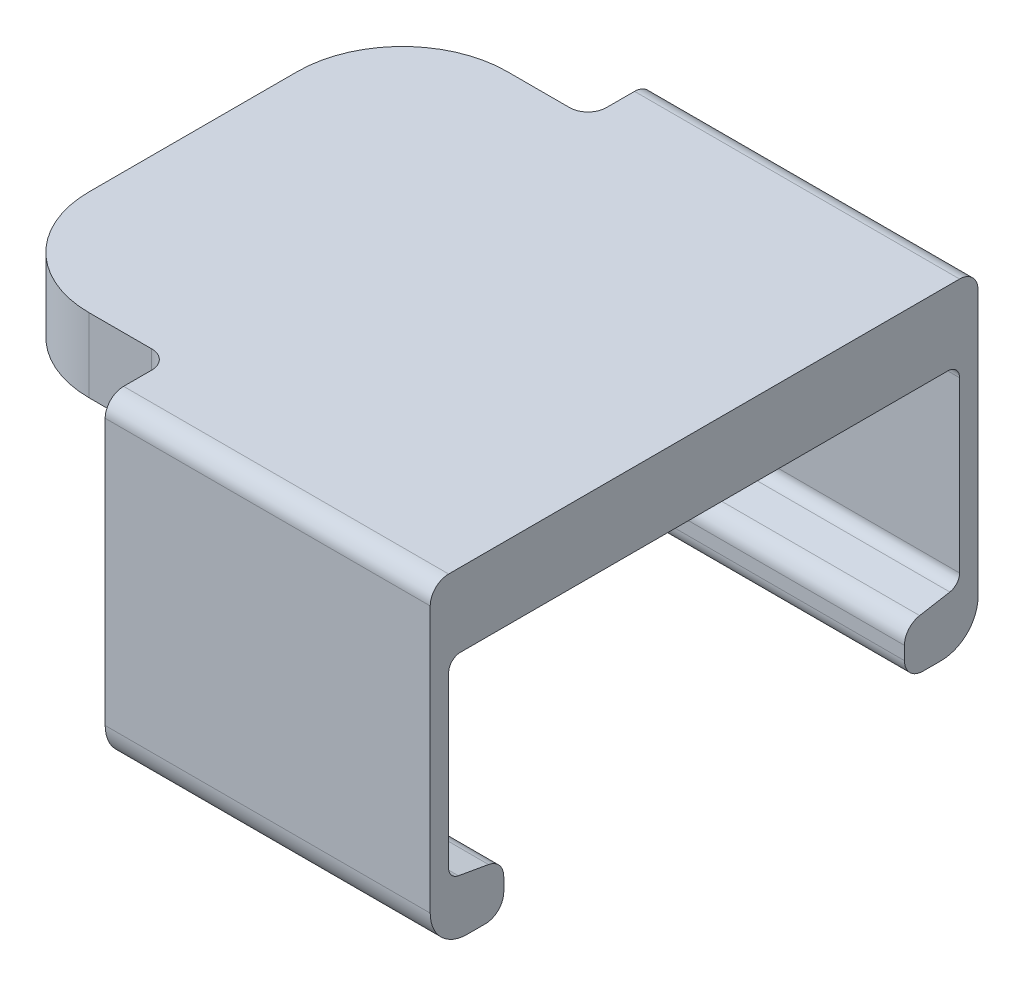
ISO-10303-21;
HEADER;
FILE_DESCRIPTION(('STEP AP214'),'2;1');
FILE_NAME('part.step','',(''),(''),'','','');
FILE_SCHEMA(('AUTOMOTIVE_DESIGN { 1 0 10303 214 1 1 1 1 }'));
ENDSEC;
DATA;
#1=APPLICATION_CONTEXT('core data for automotive mechanical design processes');
#2=APPLICATION_PROTOCOL_DEFINITION('international standard','automotive_design',2000,#1);
#3=PRODUCT_CONTEXT('',#1,'mechanical');
#4=PRODUCT('Part','Part','',(#3));
#5=PRODUCT_RELATED_PRODUCT_CATEGORY('part','',(#4));
#6=PRODUCT_DEFINITION_FORMATION('','',#4);
#7=PRODUCT_DEFINITION_CONTEXT('part definition',#1,'design');
#8=PRODUCT_DEFINITION('design','',#6,#7);
#9=PRODUCT_DEFINITION_SHAPE('','',#8);
#10=(LENGTH_UNIT() NAMED_UNIT(*) SI_UNIT(.MILLI.,.METRE.));
#11=(NAMED_UNIT(*) PLANE_ANGLE_UNIT() SI_UNIT($,.RADIAN.));
#12=(NAMED_UNIT(*) SI_UNIT($,.STERADIAN.) SOLID_ANGLE_UNIT());
#13=UNCERTAINTY_MEASURE_WITH_UNIT(LENGTH_MEASURE(1.E-05),#10,'distance_accuracy_value','');
#14=(GEOMETRIC_REPRESENTATION_CONTEXT(3) GLOBAL_UNCERTAINTY_ASSIGNED_CONTEXT((#13)) GLOBAL_UNIT_ASSIGNED_CONTEXT((#10,
#11,#12)) REPRESENTATION_CONTEXT('',''));
#15=CARTESIAN_POINT('',(0.,0.,0.));
#16=DIRECTION('',(0.,0.,1.));
#17=DIRECTION('',(1.,0.,0.));
#18=AXIS2_PLACEMENT_3D('',#15,#16,#17);
#19=CARTESIAN_POINT('',(-14.,0.,0.));
#20=DIRECTION('',(1.,0.,0.));
#21=DIRECTION('',(0.,0.,-1.));
#22=AXIS2_PLACEMENT_3D('',#19,#20,#21);
#23=PLANE('',#22);
#24=DIRECTION('',(0.,0.,1.));
#25=VECTOR('',#24,1.);
#26=CARTESIAN_POINT('',(-14.,17.358,0.));
#27=LINE('',#26,#25);
#28=CARTESIAN_POINT('',(-14.,17.358,-22.0080000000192));
#29=VERTEX_POINT('',#28);
#30=CARTESIAN_POINT('',(-14.,17.358,-19.5875));
#31=VERTEX_POINT('',#30);
#32=EDGE_CURVE('E300',#29,#31,#27,.T.);
#33=ORIENTED_EDGE('',*,*,#32,.F.);
#34=CARTESIAN_POINT('',(-14.,15.7705,-22.0080000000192));
#35=DIRECTION('',(1.,0.,0.));
#36=DIRECTION('',(0.,0.,-1.));
#37=AXIS2_PLACEMENT_3D('',#34,#35,#36);
#38=CIRCLE('',#37,1.5875);
#39=CARTESIAN_POINT('',(-14.,15.7705,-23.5955000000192));
#40=VERTEX_POINT('',#39);
#41=EDGE_CURVE('E459',#29,#40,#38,.F.);
#42=ORIENTED_EDGE('',*,*,#41,.T.);
#43=DIRECTION('',(0.,1.,0.));
#44=VECTOR('',#43,1.);
#45=CARTESIAN_POINT('',(-14.,17.358,-23.5955000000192));
#46=LINE('',#45,#44);
#47=CARTESIAN_POINT('',(-14.,-7.15034842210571,-23.5955000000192));
#48=VERTEX_POINT('',#47);
#49=EDGE_CURVE('E296',#48,#40,#46,.T.);
#50=ORIENTED_EDGE('',*,*,#49,.F.);
#51=CARTESIAN_POINT('',(-14.,-7.15034842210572,-20.4205000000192));
#52=DIRECTION('',(1.,0.,0.));
#53=DIRECTION('',(0.,0.,-1.));
#54=AXIS2_PLACEMENT_3D('',#51,#52,#53);
#55=CIRCLE('',#54,3.175);
#56=CARTESIAN_POINT('',(-14.,-10.3253484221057,-20.4205000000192));
#57=VERTEX_POINT('',#56);
#58=EDGE_CURVE('E380',#48,#57,#55,.F.);
#59=ORIENTED_EDGE('',*,*,#58,.T.);
#60=DIRECTION('',(0.,0.,-1.));
#61=VECTOR('',#60,1.);
#62=CARTESIAN_POINT('',(-14.,-10.3253484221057,-23.5955000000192));
#63=LINE('',#62,#61);
#64=CARTESIAN_POINT('',(-14.,-10.3253484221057,-18.8455000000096));
#65=VERTEX_POINT('',#64);
#66=EDGE_CURVE('E294',#65,#57,#63,.T.);
#67=ORIENTED_EDGE('',*,*,#66,.F.);
#68=CARTESIAN_POINT('',(-14.,-8.73784842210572,-18.8455000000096));
#69=DIRECTION('',(1.,0.,0.));
#70=DIRECTION('',(0.,0.,-1.));
#71=AXIS2_PLACEMENT_3D('',#68,#69,#70);
#72=CIRCLE('',#71,1.5875);
#73=CARTESIAN_POINT('',(-14.,-8.73784842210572,-17.2580000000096));
#74=VERTEX_POINT('',#73);
#75=EDGE_CURVE('E455',#65,#74,#72,.F.);
#76=ORIENTED_EDGE('',*,*,#75,.T.);
#77=DIRECTION('',(0.,-1.,0.));
#78=VECTOR('',#77,1.);
#79=CARTESIAN_POINT('',(-14.,-6.26381577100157,-17.2580000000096));
#80=LINE('',#79,#78);
#81=CARTESIAN_POINT('',(-14.,-7.5958864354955,-17.2580000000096));
#82=VERTEX_POINT('',#81);
#83=EDGE_CURVE('E291',#82,#74,#80,.T.);
#84=ORIENTED_EDGE('',*,*,#83,.F.);
#85=CARTESIAN_POINT('',(-14.,-7.5958864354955,-18.8455000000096));
#86=DIRECTION('',(1.,0.,0.));
#87=DIRECTION('',(0.,0.,-1.));
#88=AXIS2_PLACEMENT_3D('',#85,#86,#87);
#89=CIRCLE('',#88,1.5875);
#90=CARTESIAN_POINT('',(-14.,-6.03250412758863,-18.5698335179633));
#91=VERTEX_POINT('',#90);
#92=EDGE_CURVE('E453',#82,#91,#89,.F.);
#93=ORIENTED_EDGE('',*,*,#92,.T.);
#94=DIRECTION('',(0.,-0.173648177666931,0.984807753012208));
#95=VECTOR('',#94,1.);
#96=CARTESIAN_POINT('',(-14.,-6.26381577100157,-17.2580000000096));
#97=LINE('',#96,#95);
#98=CARTESIAN_POINT('',(-14.,-5.57430206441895,-21.1684265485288));
#99=VERTEX_POINT('',#98);
#100=EDGE_CURVE('E288',#99,#91,#97,.T.);
#101=ORIENTED_EDGE('',*,*,#100,.F.);
#102=CARTESIAN_POINT('',(-14.,-4.57373738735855,-20.9920000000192));
#103=DIRECTION('',(1.,0.,0.));
#104=DIRECTION('',(0.,0.,-1.));
#105=AXIS2_PLACEMENT_3D('',#102,#103,#104);
#106=CIRCLE('',#105,1.016);
#107=CARTESIAN_POINT('',(-14.,-4.57373738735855,-22.0080000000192));
#108=VERTEX_POINT('',#107);
#109=EDGE_CURVE('E412',#99,#108,#106,.T.);
#110=ORIENTED_EDGE('',*,*,#109,.T.);
#111=DIRECTION('',(0.,-1.,0.));
#112=VECTOR('',#111,1.);
#113=CARTESIAN_POINT('',(-14.,-5.42626261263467,-22.0080000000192));
#114=LINE('',#113,#112);
#115=CARTESIAN_POINT('',(-14.,9.992,-22.0080000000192));
#116=VERTEX_POINT('',#115);
#117=EDGE_CURVE('E319',#116,#108,#114,.T.);
#118=ORIENTED_EDGE('',*,*,#117,.F.);
#119=CARTESIAN_POINT('',(-14.,9.992,-20.9920000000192));
#120=DIRECTION('',(1.,0.,0.));
#121=DIRECTION('',(0.,0.,-1.));
#122=AXIS2_PLACEMENT_3D('',#119,#120,#121);
#123=CIRCLE('',#122,1.016);
#124=CARTESIAN_POINT('',(-14.,11.008,-20.9920000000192));
#125=VERTEX_POINT('',#124);
#126=EDGE_CURVE('E420',#116,#125,#123,.T.);
#127=ORIENTED_EDGE('',*,*,#126,.T.);
#128=DIRECTION('',(0.,0.,-1.));
#129=VECTOR('',#128,1.);
#130=CARTESIAN_POINT('',(-14.,11.008,0.));
#131=LINE('',#130,#129);
#132=CARTESIAN_POINT('',(-14.,11.008,-19.5875));
#133=VERTEX_POINT('',#132);
#134=EDGE_CURVE('E316',#133,#125,#131,.T.);
#135=ORIENTED_EDGE('',*,*,#134,.F.);
#136=DIRECTION('',(0.,-1.,0.));
#137=VECTOR('',#136,1.);
#138=CARTESIAN_POINT('',(-14.,17.358,-19.5875));
#139=LINE('',#138,#137);
#140=EDGE_CURVE('E457',#133,#31,#139,.F.);
#141=ORIENTED_EDGE('',*,*,#140,.T.);
#142=EDGE_LOOP('',(#33,#42,#50,#59,#67,#76,#84,#93,#101,#110,#118,#127,#135,#141));
#143=FACE_BOUND('',#142,.T.);
#144=ADVANCED_FACE('F35',(#143),#23,.F.);
#145=DIRECTION('',(0.,-1.,0.));
#146=VECTOR('',#145,1.);
#147=CARTESIAN_POINT('',(-14.,17.358,23.5955000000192));
#148=LINE('',#147,#146);
#149=CARTESIAN_POINT('',(-14.,15.7705,23.5955000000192));
#150=VERTEX_POINT('',#149);
#151=CARTESIAN_POINT('',(-14.,-7.15034842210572,23.5955000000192));
#152=VERTEX_POINT('',#151);
#153=EDGE_CURVE('E303',#150,#152,#148,.T.);
#154=ORIENTED_EDGE('',*,*,#153,.F.);
#155=CARTESIAN_POINT('',(-14.,15.7705,22.0080000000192));
#156=DIRECTION('',(1.,0.,0.));
#157=DIRECTION('',(0.,0.,-1.));
#158=AXIS2_PLACEMENT_3D('',#155,#156,#157);
#159=CIRCLE('',#158,1.5875);
#160=CARTESIAN_POINT('',(-14.,17.358,22.0080000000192));
#161=VERTEX_POINT('',#160);
#162=EDGE_CURVE('E434',#150,#161,#159,.F.);
#163=ORIENTED_EDGE('',*,*,#162,.T.);
#164=CARTESIAN_POINT('',(-14.,17.358,19.5875));
#165=VERTEX_POINT('',#164);
#166=EDGE_CURVE('E299',#165,#161,#27,.T.);
#167=ORIENTED_EDGE('',*,*,#166,.F.);
#168=DIRECTION('',(0.,1.,0.));
#169=VECTOR('',#168,1.);
#170=CARTESIAN_POINT('',(-14.,11.008,19.5875));
#171=LINE('',#170,#169);
#172=CARTESIAN_POINT('',(-14.,11.008,19.5875));
#173=VERTEX_POINT('',#172);
#174=EDGE_CURVE('E432',#165,#173,#171,.F.);
#175=ORIENTED_EDGE('',*,*,#174,.T.);
#176=CARTESIAN_POINT('',(-14.,11.008,20.9920000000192));
#177=VERTEX_POINT('',#176);
#178=EDGE_CURVE('E317',#177,#173,#131,.T.);
#179=ORIENTED_EDGE('',*,*,#178,.F.);
#180=CARTESIAN_POINT('',(-14.,9.992,20.9920000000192));
#181=DIRECTION('',(1.,0.,0.));
#182=DIRECTION('',(0.,0.,-1.));
#183=AXIS2_PLACEMENT_3D('',#180,#181,#182);
#184=CIRCLE('',#183,1.016);
#185=CARTESIAN_POINT('',(-14.,9.992,22.0080000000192));
#186=VERTEX_POINT('',#185);
#187=EDGE_CURVE('E416',#177,#186,#184,.T.);
#188=ORIENTED_EDGE('',*,*,#187,.T.);
#189=DIRECTION('',(0.,1.,0.));
#190=VECTOR('',#189,1.);
#191=CARTESIAN_POINT('',(-14.,-5.42626261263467,22.0080000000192));
#192=LINE('',#191,#190);
#193=CARTESIAN_POINT('',(-14.,-4.57373738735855,22.0080000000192));
#194=VERTEX_POINT('',#193);
#195=EDGE_CURVE('E313',#194,#186,#192,.T.);
#196=ORIENTED_EDGE('',*,*,#195,.F.);
#197=CARTESIAN_POINT('',(-14.,-4.57373738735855,20.9920000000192));
#198=DIRECTION('',(1.,0.,0.));
#199=DIRECTION('',(0.,0.,-1.));
#200=AXIS2_PLACEMENT_3D('',#197,#198,#199);
#201=CIRCLE('',#200,1.016);
#202=CARTESIAN_POINT('',(-14.,-5.57430206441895,21.1684265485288));
#203=VERTEX_POINT('',#202);
#204=EDGE_CURVE('E407',#194,#203,#201,.T.);
#205=ORIENTED_EDGE('',*,*,#204,.T.);
#206=DIRECTION('',(0.,0.173648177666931,0.984807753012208));
#207=VECTOR('',#206,1.);
#208=CARTESIAN_POINT('',(-14.,-6.26381577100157,17.2580000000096));
#209=LINE('',#208,#207);
#210=CARTESIAN_POINT('',(-14.,-6.03250412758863,18.5698335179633));
#211=VERTEX_POINT('',#210);
#212=EDGE_CURVE('E311',#211,#203,#209,.T.);
#213=ORIENTED_EDGE('',*,*,#212,.F.);
#214=CARTESIAN_POINT('',(-14.,-7.5958864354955,18.8455000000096));
#215=DIRECTION('',(1.,0.,0.));
#216=DIRECTION('',(0.,0.,-1.));
#217=AXIS2_PLACEMENT_3D('',#214,#215,#216);
#218=CIRCLE('',#217,1.5875);
#219=CARTESIAN_POINT('',(-14.,-7.5958864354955,17.2580000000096));
#220=VERTEX_POINT('',#219);
#221=EDGE_CURVE('E428',#211,#220,#218,.F.);
#222=ORIENTED_EDGE('',*,*,#221,.T.);
#223=DIRECTION('',(0.,1.,0.));
#224=VECTOR('',#223,1.);
#225=CARTESIAN_POINT('',(-14.,-6.26381577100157,17.2580000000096));
#226=LINE('',#225,#224);
#227=CARTESIAN_POINT('',(-14.,-8.73784842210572,17.2580000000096));
#228=VERTEX_POINT('',#227);
#229=EDGE_CURVE('E308',#228,#220,#226,.T.);
#230=ORIENTED_EDGE('',*,*,#229,.F.);
#231=CARTESIAN_POINT('',(-14.,-8.73784842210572,18.8455000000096));
#232=DIRECTION('',(1.,0.,0.));
#233=DIRECTION('',(0.,0.,-1.));
#234=AXIS2_PLACEMENT_3D('',#231,#232,#233);
#235=CIRCLE('',#234,1.5875);
#236=CARTESIAN_POINT('',(-14.,-10.3253484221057,18.8455000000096));
#237=VERTEX_POINT('',#236);
#238=EDGE_CURVE('E430',#228,#237,#235,.F.);
#239=ORIENTED_EDGE('',*,*,#238,.T.);
#240=DIRECTION('',(0.,0.,-1.));
#241=VECTOR('',#240,1.);
#242=CARTESIAN_POINT('',(-14.,-10.3253484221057,23.5955000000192));
#243=LINE('',#242,#241);
#244=CARTESIAN_POINT('',(-14.,-10.3253484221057,20.4205000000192));
#245=VERTEX_POINT('',#244);
#246=EDGE_CURVE('E305',#245,#237,#243,.T.);
#247=ORIENTED_EDGE('',*,*,#246,.F.);
#248=CARTESIAN_POINT('',(-14.,-7.15034842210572,20.4205000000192));
#249=DIRECTION('',(1.,0.,0.));
#250=DIRECTION('',(0.,0.,-1.));
#251=AXIS2_PLACEMENT_3D('',#248,#249,#250);
#252=CIRCLE('',#251,3.175);
#253=EDGE_CURVE('E367',#245,#152,#252,.F.);
#254=ORIENTED_EDGE('',*,*,#253,.T.);
#255=EDGE_LOOP('',(#154,#163,#167,#175,#179,#188,#196,#205,#213,#222,#230,#239,#247,#254));
#256=FACE_BOUND('',#255,.T.);
#257=ADVANCED_FACE('F518',(#256),#23,.F.);
#258=CARTESIAN_POINT('',(14.,-6.26381577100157,-17.2580000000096));
#259=DIRECTION('',(0.,-0.984807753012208,-0.173648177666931));
#260=DIRECTION('',(0.,0.173648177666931,-0.984807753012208));
#261=AXIS2_PLACEMENT_3D('',#258,#259,#260);
#262=PLANE('',#261);
#263=ORIENTED_EDGE('',*,*,#100,.T.);
#264=DIRECTION('',(-1.,0.,0.));
#265=VECTOR('',#264,1.);
#266=CARTESIAN_POINT('',(14.,-6.03250412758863,-18.5698335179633));
#267=LINE('',#266,#265);
#268=CARTESIAN_POINT('',(14.,-6.03250412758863,-18.5698335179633));
#269=VERTEX_POINT('',#268);
#270=EDGE_CURVE('E486',#91,#269,#267,.F.);
#271=ORIENTED_EDGE('',*,*,#270,.T.);
#272=DIRECTION('',(0.,-0.173648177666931,0.984807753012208));
#273=VECTOR('',#272,1.);
#274=CARTESIAN_POINT('',(14.,-6.26381577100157,-17.2580000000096));
#275=LINE('',#274,#273);
#276=CARTESIAN_POINT('',(14.,-5.57430206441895,-21.1684265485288));
#277=VERTEX_POINT('',#276);
#278=EDGE_CURVE('E322',#277,#269,#275,.T.);
#279=ORIENTED_EDGE('',*,*,#278,.F.);
#280=DIRECTION('',(-1.,0.,0.));
#281=VECTOR('',#280,1.);
#282=CARTESIAN_POINT('',(-14.,-5.57430206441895,-21.1684265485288));
#283=LINE('',#282,#281);
#284=EDGE_CURVE('E394',#277,#99,#283,.T.);
#285=ORIENTED_EDGE('',*,*,#284,.T.);
#286=EDGE_LOOP('',(#263,#271,#279,#285));
#287=FACE_BOUND('',#286,.T.);
#288=ADVANCED_FACE('F522',(#287),#262,.F.);
#289=CARTESIAN_POINT('',(14.,-6.26381577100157,-17.2580000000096));
#290=DIRECTION('',(0.,0.,-1.));
#291=DIRECTION('',(-1.,0.,0.));
#292=AXIS2_PLACEMENT_3D('',#289,#290,#291);
#293=PLANE('',#292);
#294=ORIENTED_EDGE('',*,*,#83,.T.);
#295=DIRECTION('',(-1.,0.,0.));
#296=VECTOR('',#295,1.);
#297=CARTESIAN_POINT('',(14.,-8.73784842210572,-17.2580000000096));
#298=LINE('',#297,#296);
#299=CARTESIAN_POINT('',(14.,-8.73784842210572,-17.2580000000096));
#300=VERTEX_POINT('',#299);
#301=EDGE_CURVE('E474',#74,#300,#298,.F.);
#302=ORIENTED_EDGE('',*,*,#301,.T.);
#303=DIRECTION('',(0.,-1.,0.));
#304=VECTOR('',#303,1.);
#305=CARTESIAN_POINT('',(14.,-6.26381577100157,-17.2580000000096));
#306=LINE('',#305,#304);
#307=CARTESIAN_POINT('',(14.,-7.5958864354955,-17.2580000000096));
#308=VERTEX_POINT('',#307);
#309=EDGE_CURVE('E325',#308,#300,#306,.T.);
#310=ORIENTED_EDGE('',*,*,#309,.F.);
#311=DIRECTION('',(-1.,0.,0.));
#312=VECTOR('',#311,1.);
#313=CARTESIAN_POINT('',(14.,-7.5958864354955,-17.2580000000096));
#314=LINE('',#313,#312);
#315=EDGE_CURVE('E471',#308,#82,#314,.T.);
#316=ORIENTED_EDGE('',*,*,#315,.T.);
#317=EDGE_LOOP('',(#294,#302,#310,#316));
#318=FACE_BOUND('',#317,.T.);
#319=ADVANCED_FACE('F560',(#318),#293,.F.);
#320=CARTESIAN_POINT('',(14.,-10.3253484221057,-23.5955000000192));
#321=DIRECTION('',(0.,1.,0.));
#322=DIRECTION('',(0.,0.,1.));
#323=AXIS2_PLACEMENT_3D('',#320,#321,#322);
#324=PLANE('',#323);
#325=DIRECTION('',(0.,0.,-1.));
#326=VECTOR('',#325,1.);
#327=CARTESIAN_POINT('',(14.,-10.3253484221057,-23.5955000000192));
#328=LINE('',#327,#326);
#329=CARTESIAN_POINT('',(14.,-10.3253484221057,-18.8455000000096));
#330=VERTEX_POINT('',#329);
#331=CARTESIAN_POINT('',(14.,-10.3253484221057,-20.4205000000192));
#332=VERTEX_POINT('',#331);
#333=EDGE_CURVE('E328',#330,#332,#328,.T.);
#334=ORIENTED_EDGE('',*,*,#333,.F.);
#335=DIRECTION('',(-1.,0.,0.));
#336=VECTOR('',#335,1.);
#337=CARTESIAN_POINT('',(14.,-10.3253484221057,-18.8455000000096));
#338=LINE('',#337,#336);
#339=EDGE_CURVE('E468',#330,#65,#338,.T.);
#340=ORIENTED_EDGE('',*,*,#339,.T.);
#341=ORIENTED_EDGE('',*,*,#66,.T.);
#342=DIRECTION('',(-1.,0.,0.));
#343=VECTOR('',#342,1.);
#344=CARTESIAN_POINT('',(14.,-10.3253484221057,-20.4205000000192));
#345=LINE('',#344,#343);
#346=EDGE_CURVE('E383',#57,#332,#345,.F.);
#347=ORIENTED_EDGE('',*,*,#346,.T.);
#348=EDGE_LOOP('',(#334,#340,#341,#347));
#349=FACE_BOUND('',#348,.T.);
#350=ADVANCED_FACE('F556',(#349),#324,.F.);
#351=CARTESIAN_POINT('',(14.,17.358,-23.5955000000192));
#352=DIRECTION('',(0.,0.,1.));
#353=DIRECTION('',(0.,-1.,0.));
#354=AXIS2_PLACEMENT_3D('',#351,#352,#353);
#355=PLANE('',#354);
#356=ORIENTED_EDGE('',*,*,#49,.T.);
#357=DIRECTION('',(-1.,0.,0.));
#358=VECTOR('',#357,1.);
#359=CARTESIAN_POINT('',(14.,15.7705,-23.5955000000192));
#360=LINE('',#359,#358);
#361=CARTESIAN_POINT('',(14.,15.7705,-23.5955000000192));
#362=VERTEX_POINT('',#361);
#363=EDGE_CURVE('E461',#40,#362,#360,.F.);
#364=ORIENTED_EDGE('',*,*,#363,.T.);
#365=DIRECTION('',(0.,1.,0.));
#366=VECTOR('',#365,1.);
#367=CARTESIAN_POINT('',(14.,17.358,-23.5955000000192));
#368=LINE('',#367,#366);
#369=CARTESIAN_POINT('',(14.,-7.15034842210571,-23.5955000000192));
#370=VERTEX_POINT('',#369);
#371=EDGE_CURVE('E330',#370,#362,#368,.T.);
#372=ORIENTED_EDGE('',*,*,#371,.F.);
#373=DIRECTION('',(-1.,0.,0.));
#374=VECTOR('',#373,1.);
#375=CARTESIAN_POINT('',(14.,-7.15034842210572,-23.5955000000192));
#376=LINE('',#375,#374);
#377=EDGE_CURVE('E377',#370,#48,#376,.T.);
#378=ORIENTED_EDGE('',*,*,#377,.T.);
#379=EDGE_LOOP('',(#356,#364,#372,#378));
#380=FACE_BOUND('',#379,.T.);
#381=ADVANCED_FACE('F553',(#380),#355,.F.);
#382=CARTESIAN_POINT('',(14.,17.358,0.));
#383=DIRECTION('',(0.,-1.,0.));
#384=DIRECTION('',(0.,0.,-1.));
#385=AXIS2_PLACEMENT_3D('',#382,#383,#384);
#386=PLANE('',#385);
#387=ORIENTED_EDGE('',*,*,#166,.T.);
#388=DIRECTION('',(-1.,0.,0.));
#389=VECTOR('',#388,1.);
#390=CARTESIAN_POINT('',(14.,17.358,22.0080000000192));
#391=LINE('',#390,#389);
#392=CARTESIAN_POINT('',(14.,17.358,22.0080000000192));
#393=VERTEX_POINT('',#392);
#394=EDGE_CURVE('E439',#161,#393,#391,.F.);
#395=ORIENTED_EDGE('',*,*,#394,.T.);
#396=DIRECTION('',(0.,0.,1.));
#397=VECTOR('',#396,1.);
#398=CARTESIAN_POINT('',(14.,17.358,0.));
#399=LINE('',#398,#397);
#400=CARTESIAN_POINT('',(14.,17.358,-22.0080000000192));
#401=VERTEX_POINT('',#400);
#402=EDGE_CURVE('E333',#401,#393,#399,.T.);
#403=ORIENTED_EDGE('',*,*,#402,.F.);
#404=DIRECTION('',(-1.,0.,0.));
#405=VECTOR('',#404,1.);
#406=CARTESIAN_POINT('',(14.,17.358,-22.0080000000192));
#407=LINE('',#406,#405);
#408=EDGE_CURVE('E436',#401,#29,#407,.T.);
#409=ORIENTED_EDGE('',*,*,#408,.T.);
#410=ORIENTED_EDGE('',*,*,#32,.T.);
#411=CARTESIAN_POINT('',(-15.5875,17.358,-19.5875));
#412=DIRECTION('',(0.,-1.,0.));
#413=DIRECTION('',(0.,0.,-1.));
#414=AXIS2_PLACEMENT_3D('',#411,#412,#413);
#415=CIRCLE('',#414,1.5875);
#416=CARTESIAN_POINT('',(-15.5875,17.358,-18.));
#417=VERTEX_POINT('',#416);
#418=EDGE_CURVE('E11',#31,#417,#415,.T.);
#419=ORIENTED_EDGE('',*,*,#418,.T.);
#420=DIRECTION('',(1.,0.,0.));
#421=VECTOR('',#420,1.);
#422=CARTESIAN_POINT('',(-30.,17.358,-18.));
#423=LINE('',#422,#421);
#424=CARTESIAN_POINT('',(-20.9703,17.358,-18.));
#425=VERTEX_POINT('',#424);
#426=EDGE_CURVE('E272',#425,#417,#423,.T.);
#427=ORIENTED_EDGE('',*,*,#426,.F.);
#428=CARTESIAN_POINT('',(-20.9703,17.358,-8.9703));
#429=DIRECTION('',(0.,-1.,0.));
#430=DIRECTION('',(0.,0.,-1.));
#431=AXIS2_PLACEMENT_3D('',#428,#429,#430);
#432=CIRCLE('',#431,9.0297);
#433=CARTESIAN_POINT('',(-30.,17.358,-8.9703));
#434=VERTEX_POINT('',#433);
#435=EDGE_CURVE('E360',#425,#434,#432,.F.);
#436=ORIENTED_EDGE('',*,*,#435,.T.);
#437=DIRECTION('',(0.,0.,-1.));
#438=VECTOR('',#437,1.);
#439=CARTESIAN_POINT('',(-30.,17.358,-18.));
#440=LINE('',#439,#438);
#441=CARTESIAN_POINT('',(-30.,17.358,8.9703));
#442=VERTEX_POINT('',#441);
#443=EDGE_CURVE('E264',#442,#434,#440,.T.);
#444=ORIENTED_EDGE('',*,*,#443,.F.);
#445=CARTESIAN_POINT('',(-20.9703,17.358,8.97029999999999));
#446=DIRECTION('',(0.,-1.,0.));
#447=DIRECTION('',(0.,0.,-1.));
#448=AXIS2_PLACEMENT_3D('',#445,#446,#447);
#449=CIRCLE('',#448,9.0297);
#450=CARTESIAN_POINT('',(-20.9703,17.358,18.));
#451=VERTEX_POINT('',#450);
#452=EDGE_CURVE('E358',#442,#451,#449,.F.);
#453=ORIENTED_EDGE('',*,*,#452,.T.);
#454=DIRECTION('',(1.,0.,0.));
#455=VECTOR('',#454,1.);
#456=CARTESIAN_POINT('',(-30.,17.358,18.));
#457=LINE('',#456,#455);
#458=CARTESIAN_POINT('',(-15.5875,17.358,18.));
#459=VERTEX_POINT('',#458);
#460=EDGE_CURVE('E281',#451,#459,#457,.T.);
#461=ORIENTED_EDGE('',*,*,#460,.T.);
#462=CARTESIAN_POINT('',(-15.5875,17.358,19.5875));
#463=DIRECTION('',(0.,-1.,0.));
#464=DIRECTION('',(0.,0.,-1.));
#465=AXIS2_PLACEMENT_3D('',#462,#463,#464);
#466=CIRCLE('',#465,1.5875);
#467=EDGE_CURVE('E488',#459,#165,#466,.T.);
#468=ORIENTED_EDGE('',*,*,#467,.T.);
#469=EDGE_LOOP('',(#387,#395,#403,#409,#410,#419,#427,#436,#444,#453,#461,#468));
#470=FACE_BOUND('',#469,.T.);
#471=ADVANCED_FACE('F500',(#470),#386,.F.);
#472=CARTESIAN_POINT('',(14.,17.358,23.5955000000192));
#473=DIRECTION('',(0.,0.,-1.));
#474=DIRECTION('',(0.,1.,0.));
#475=AXIS2_PLACEMENT_3D('',#472,#473,#474);
#476=PLANE('',#475);
#477=DIRECTION('',(0.,-1.,0.));
#478=VECTOR('',#477,1.);
#479=CARTESIAN_POINT('',(14.,17.358,23.5955000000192));
#480=LINE('',#479,#478);
#481=CARTESIAN_POINT('',(14.,15.7705,23.5955000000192));
#482=VERTEX_POINT('',#481);
#483=CARTESIAN_POINT('',(14.,-7.15034842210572,23.5955000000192));
#484=VERTEX_POINT('',#483);
#485=EDGE_CURVE('E336',#482,#484,#480,.T.);
#486=ORIENTED_EDGE('',*,*,#485,.F.);
#487=DIRECTION('',(-1.,0.,0.));
#488=VECTOR('',#487,1.);
#489=CARTESIAN_POINT('',(14.,15.7705,23.5955000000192));
#490=LINE('',#489,#488);
#491=EDGE_CURVE('E425',#482,#150,#490,.T.);
#492=ORIENTED_EDGE('',*,*,#491,.T.);
#493=ORIENTED_EDGE('',*,*,#153,.T.);
#494=DIRECTION('',(-1.,0.,0.));
#495=VECTOR('',#494,1.);
#496=CARTESIAN_POINT('',(14.,-7.15034842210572,23.5955000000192));
#497=LINE('',#496,#495);
#498=EDGE_CURVE('E370',#152,#484,#497,.F.);
#499=ORIENTED_EDGE('',*,*,#498,.T.);
#500=EDGE_LOOP('',(#486,#492,#493,#499));
#501=FACE_BOUND('',#500,.T.);
#502=ADVANCED_FACE('F546',(#501),#476,.F.);
#503=CARTESIAN_POINT('',(14.,-10.3253484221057,23.5955000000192));
#504=DIRECTION('',(0.,1.,0.));
#505=DIRECTION('',(0.,0.,1.));
#506=AXIS2_PLACEMENT_3D('',#503,#504,#505);
#507=PLANE('',#506);
#508=ORIENTED_EDGE('',*,*,#246,.T.);
#509=DIRECTION('',(-1.,0.,0.));
#510=VECTOR('',#509,1.);
#511=CARTESIAN_POINT('',(14.,-10.3253484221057,18.8455000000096));
#512=LINE('',#511,#510);
#513=CARTESIAN_POINT('',(14.,-10.3253484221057,18.8455000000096));
#514=VERTEX_POINT('',#513);
#515=EDGE_CURVE('E481',#237,#514,#512,.F.);
#516=ORIENTED_EDGE('',*,*,#515,.T.);
#517=DIRECTION('',(0.,0.,-1.));
#518=VECTOR('',#517,1.);
#519=CARTESIAN_POINT('',(14.,-10.3253484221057,23.5955000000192));
#520=LINE('',#519,#518);
#521=CARTESIAN_POINT('',(14.,-10.3253484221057,20.4205000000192));
#522=VERTEX_POINT('',#521);
#523=EDGE_CURVE('E338',#522,#514,#520,.T.);
#524=ORIENTED_EDGE('',*,*,#523,.F.);
#525=DIRECTION('',(-1.,0.,0.));
#526=VECTOR('',#525,1.);
#527=CARTESIAN_POINT('',(14.,-10.3253484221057,20.4205000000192));
#528=LINE('',#527,#526);
#529=EDGE_CURVE('E364',#522,#245,#528,.T.);
#530=ORIENTED_EDGE('',*,*,#529,.T.);
#531=EDGE_LOOP('',(#508,#516,#524,#530));
#532=FACE_BOUND('',#531,.T.);
#533=ADVANCED_FACE('F542',(#532),#507,.F.);
#534=CARTESIAN_POINT('',(14.,-6.26381577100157,17.2580000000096));
#535=DIRECTION('',(0.,0.,1.));
#536=DIRECTION('',(1.,0.,0.));
#537=AXIS2_PLACEMENT_3D('',#534,#535,#536);
#538=PLANE('',#537);
#539=DIRECTION('',(0.,1.,0.));
#540=VECTOR('',#539,1.);
#541=CARTESIAN_POINT('',(14.,-6.26381577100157,17.2580000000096));
#542=LINE('',#541,#540);
#543=CARTESIAN_POINT('',(14.,-8.73784842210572,17.2580000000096));
#544=VERTEX_POINT('',#543);
#545=CARTESIAN_POINT('',(14.,-7.5958864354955,17.2580000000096));
#546=VERTEX_POINT('',#545);
#547=EDGE_CURVE('E341',#544,#546,#542,.T.);
#548=ORIENTED_EDGE('',*,*,#547,.F.);
#549=DIRECTION('',(-1.,0.,0.));
#550=VECTOR('',#549,1.);
#551=CARTESIAN_POINT('',(14.,-8.73784842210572,17.2580000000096));
#552=LINE('',#551,#550);
#553=EDGE_CURVE('E478',#544,#228,#552,.T.);
#554=ORIENTED_EDGE('',*,*,#553,.T.);
#555=ORIENTED_EDGE('',*,*,#229,.T.);
#556=DIRECTION('',(-1.,0.,0.));
#557=VECTOR('',#556,1.);
#558=CARTESIAN_POINT('',(14.,-7.5958864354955,17.2580000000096));
#559=LINE('',#558,#557);
#560=EDGE_CURVE('E476',#220,#546,#559,.F.);
#561=ORIENTED_EDGE('',*,*,#560,.T.);
#562=EDGE_LOOP('',(#548,#554,#555,#561));
#563=FACE_BOUND('',#562,.T.);
#564=ADVANCED_FACE('F538',(#563),#538,.F.);
#565=CARTESIAN_POINT('',(14.,-6.26381577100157,17.2580000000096));
#566=DIRECTION('',(0.,-0.984807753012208,0.173648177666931));
#567=DIRECTION('',(0.,-0.173648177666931,-0.984807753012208));
#568=AXIS2_PLACEMENT_3D('',#565,#566,#567);
#569=PLANE('',#568);
#570=DIRECTION('',(0.,0.173648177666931,0.984807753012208));
#571=VECTOR('',#570,1.);
#572=CARTESIAN_POINT('',(14.,-6.26381577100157,17.2580000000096));
#573=LINE('',#572,#571);
#574=CARTESIAN_POINT('',(14.,-6.03250412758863,18.5698335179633));
#575=VERTEX_POINT('',#574);
#576=CARTESIAN_POINT('',(14.,-5.57430206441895,21.1684265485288));
#577=VERTEX_POINT('',#576);
#578=EDGE_CURVE('E344',#575,#577,#573,.T.);
#579=ORIENTED_EDGE('',*,*,#578,.F.);
#580=DIRECTION('',(-1.,0.,0.));
#581=VECTOR('',#580,1.);
#582=CARTESIAN_POINT('',(14.,-6.03250412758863,18.5698335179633));
#583=LINE('',#582,#581);
#584=EDGE_CURVE('E483',#575,#211,#583,.T.);
#585=ORIENTED_EDGE('',*,*,#584,.T.);
#586=ORIENTED_EDGE('',*,*,#212,.T.);
#587=DIRECTION('',(-1.,0.,0.));
#588=VECTOR('',#587,1.);
#589=CARTESIAN_POINT('',(14.,-5.57430206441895,21.1684265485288));
#590=LINE('',#589,#588);
#591=EDGE_CURVE('E391',#203,#577,#590,.F.);
#592=ORIENTED_EDGE('',*,*,#591,.T.);
#593=EDGE_LOOP('',(#579,#585,#586,#592));
#594=FACE_BOUND('',#593,.T.);
#595=ADVANCED_FACE('F534',(#594),#569,.F.);
#596=CARTESIAN_POINT('',(14.,-5.42626261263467,22.0080000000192));
#597=DIRECTION('',(0.,0.,1.));
#598=DIRECTION('',(1.,0.,0.));
#599=AXIS2_PLACEMENT_3D('',#596,#597,#598);
#600=PLANE('',#599);
#601=DIRECTION('',(0.,1.,0.));
#602=VECTOR('',#601,1.);
#603=CARTESIAN_POINT('',(14.,-5.42626261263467,22.0080000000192));
#604=LINE('',#603,#602);
#605=CARTESIAN_POINT('',(14.,-4.57373738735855,22.0080000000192));
#606=VERTEX_POINT('',#605);
#607=CARTESIAN_POINT('',(14.,9.992,22.0080000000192));
#608=VERTEX_POINT('',#607);
#609=EDGE_CURVE('E346',#606,#608,#604,.T.);
#610=ORIENTED_EDGE('',*,*,#609,.F.);
#611=DIRECTION('',(-1.,0.,0.));
#612=VECTOR('',#611,1.);
#613=CARTESIAN_POINT('',(-14.,-4.57373738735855,22.0080000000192));
#614=LINE('',#613,#612);
#615=EDGE_CURVE('E388',#606,#194,#614,.T.);
#616=ORIENTED_EDGE('',*,*,#615,.T.);
#617=ORIENTED_EDGE('',*,*,#195,.T.);
#618=DIRECTION('',(-1.,0.,0.));
#619=VECTOR('',#618,1.);
#620=CARTESIAN_POINT('',(14.,9.992,22.0080000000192));
#621=LINE('',#620,#619);
#622=EDGE_CURVE('E386',#186,#608,#621,.F.);
#623=ORIENTED_EDGE('',*,*,#622,.T.);
#624=EDGE_LOOP('',(#610,#616,#617,#623));
#625=FACE_BOUND('',#624,.T.);
#626=ADVANCED_FACE('F530',(#625),#600,.F.);
#627=CARTESIAN_POINT('',(14.,11.008,0.));
#628=DIRECTION('',(0.,1.,0.));
#629=DIRECTION('',(0.,0.,1.));
#630=AXIS2_PLACEMENT_3D('',#627,#628,#629);
#631=PLANE('',#630);
#632=CARTESIAN_POINT('',(-20.1575,11.008,8.15749999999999));
#633=DIRECTION('',(0.,-1.,0.));
#634=DIRECTION('',(0.,0.,-1.));
#635=AXIS2_PLACEMENT_3D('',#632,#633,#634);
#636=CIRCLE('',#635,9.0297);
#637=CARTESIAN_POINT('',(-20.1575,11.008,-0.872200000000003));
#638=VERTEX_POINT('',#637);
#639=EDGE_CURVE('E275',#638,#638,#636,.T.);
#640=ORIENTED_EDGE('',*,*,#639,.F.);
#641=EDGE_LOOP('',(#640));
#642=FACE_BOUND('',#641,.T.);
#643=DIRECTION('',(0.,0.,-1.));
#644=VECTOR('',#643,1.);
#645=CARTESIAN_POINT('',(14.,11.008,0.));
#646=LINE('',#645,#644);
#647=CARTESIAN_POINT('',(14.,11.008,20.9920000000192));
#648=VERTEX_POINT('',#647);
#649=CARTESIAN_POINT('',(14.,11.008,-20.9920000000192));
#650=VERTEX_POINT('',#649);
#651=EDGE_CURVE('E349',#648,#650,#646,.T.);
#652=ORIENTED_EDGE('',*,*,#651,.F.);
#653=DIRECTION('',(-1.,0.,0.));
#654=VECTOR('',#653,1.);
#655=CARTESIAN_POINT('',(-14.,11.008,20.9920000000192));
#656=LINE('',#655,#654);
#657=EDGE_CURVE('E404',#648,#177,#656,.T.);
#658=ORIENTED_EDGE('',*,*,#657,.T.);
#659=ORIENTED_EDGE('',*,*,#178,.T.);
#660=CARTESIAN_POINT('',(-15.5875,11.008,19.5875));
#661=DIRECTION('',(0.,1.,0.));
#662=DIRECTION('',(0.,0.,1.));
#663=AXIS2_PLACEMENT_3D('',#660,#661,#662);
#664=CIRCLE('',#663,1.5875);
#665=CARTESIAN_POINT('',(-15.5875,11.008,18.));
#666=VERTEX_POINT('',#665);
#667=EDGE_CURVE('E57',#173,#666,#664,.T.);
#668=ORIENTED_EDGE('',*,*,#667,.T.);
#669=DIRECTION('',(1.,0.,0.));
#670=VECTOR('',#669,1.);
#671=CARTESIAN_POINT('',(-30.,11.008,18.));
#672=LINE('',#671,#670);
#673=CARTESIAN_POINT('',(-20.9703,11.008,18.));
#674=VERTEX_POINT('',#673);
#675=EDGE_CURVE('E284',#674,#666,#672,.T.);
#676=ORIENTED_EDGE('',*,*,#675,.F.);
#677=CARTESIAN_POINT('',(-20.9703,11.008,8.97029999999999));
#678=DIRECTION('',(0.,1.,0.));
#679=DIRECTION('',(0.,0.,1.));
#680=AXIS2_PLACEMENT_3D('',#677,#678,#679);
#681=CIRCLE('',#680,9.0297);
#682=CARTESIAN_POINT('',(-30.,11.008,8.9703));
#683=VERTEX_POINT('',#682);
#684=EDGE_CURVE('E254',#674,#683,#681,.F.);
#685=ORIENTED_EDGE('',*,*,#684,.T.);
#686=DIRECTION('',(0.,0.,1.));
#687=VECTOR('',#686,1.);
#688=CARTESIAN_POINT('',(-30.,11.008,-18.));
#689=LINE('',#688,#687);
#690=CARTESIAN_POINT('',(-30.,11.008,-8.9703));
#691=VERTEX_POINT('',#690);
#692=EDGE_CURVE('E261',#691,#683,#689,.T.);
#693=ORIENTED_EDGE('',*,*,#692,.F.);
#694=CARTESIAN_POINT('',(-20.9703,11.008,-8.9703));
#695=DIRECTION('',(0.,1.,0.));
#696=DIRECTION('',(0.,0.,1.));
#697=AXIS2_PLACEMENT_3D('',#694,#695,#696);
#698=CIRCLE('',#697,9.0297);
#699=CARTESIAN_POINT('',(-20.9703,11.008,-18.));
#700=VERTEX_POINT('',#699);
#701=EDGE_CURVE('E245',#691,#700,#698,.F.);
#702=ORIENTED_EDGE('',*,*,#701,.T.);
#703=DIRECTION('',(1.,0.,0.));
#704=VECTOR('',#703,1.);
#705=CARTESIAN_POINT('',(-30.,11.008,-18.));
#706=LINE('',#705,#704);
#707=CARTESIAN_POINT('',(-15.5875,11.008,-18.));
#708=VERTEX_POINT('',#707);
#709=EDGE_CURVE('E286',#700,#708,#706,.T.);
#710=ORIENTED_EDGE('',*,*,#709,.T.);
#711=CARTESIAN_POINT('',(-15.5875,11.008,-19.5875));
#712=DIRECTION('',(0.,1.,0.));
#713=DIRECTION('',(0.,0.,1.));
#714=AXIS2_PLACEMENT_3D('',#711,#712,#713);
#715=CIRCLE('',#714,1.5875);
#716=EDGE_CURVE('E43',#708,#133,#715,.T.);
#717=ORIENTED_EDGE('',*,*,#716,.T.);
#718=ORIENTED_EDGE('',*,*,#134,.T.);
#719=DIRECTION('',(-1.,0.,0.));
#720=VECTOR('',#719,1.);
#721=CARTESIAN_POINT('',(14.,11.008,-20.9920000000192));
#722=LINE('',#721,#720);
#723=EDGE_CURVE('E402',#125,#650,#722,.F.);
#724=ORIENTED_EDGE('',*,*,#723,.T.);
#725=EDGE_LOOP('',(#652,#658,#659,#668,#676,#685,#693,#702,#710,#717,#718,#724));
#726=FACE_BOUND('',#725,.T.);
#727=ADVANCED_FACE('F268',(#642,#726),#631,.F.);
#728=CARTESIAN_POINT('',(14.,-5.42626261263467,-22.0080000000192));
#729=DIRECTION('',(0.,0.,-1.));
#730=DIRECTION('',(-1.,0.,0.));
#731=AXIS2_PLACEMENT_3D('',#728,#729,#730);
#732=PLANE('',#731);
#733=ORIENTED_EDGE('',*,*,#117,.T.);
#734=DIRECTION('',(-1.,0.,0.));
#735=VECTOR('',#734,1.);
#736=CARTESIAN_POINT('',(14.,-4.57373738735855,-22.0080000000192));
#737=LINE('',#736,#735);
#738=CARTESIAN_POINT('',(14.,-4.57373738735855,-22.0080000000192));
#739=VERTEX_POINT('',#738);
#740=EDGE_CURVE('E400',#108,#739,#737,.F.);
#741=ORIENTED_EDGE('',*,*,#740,.T.);
#742=DIRECTION('',(0.,-1.,0.));
#743=VECTOR('',#742,1.);
#744=CARTESIAN_POINT('',(14.,-5.42626261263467,-22.0080000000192));
#745=LINE('',#744,#743);
#746=CARTESIAN_POINT('',(14.,9.992,-22.0080000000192));
#747=VERTEX_POINT('',#746);
#748=EDGE_CURVE('E352',#747,#739,#745,.T.);
#749=ORIENTED_EDGE('',*,*,#748,.F.);
#750=DIRECTION('',(-1.,0.,0.));
#751=VECTOR('',#750,1.);
#752=CARTESIAN_POINT('',(-14.,9.992,-22.0080000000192));
#753=LINE('',#752,#751);
#754=EDGE_CURVE('E397',#747,#116,#753,.T.);
#755=ORIENTED_EDGE('',*,*,#754,.T.);
#756=EDGE_LOOP('',(#733,#741,#749,#755));
#757=FACE_BOUND('',#756,.T.);
#758=ADVANCED_FACE('F513',(#757),#732,.F.);
#759=CARTESIAN_POINT('',(14.,0.,0.));
#760=DIRECTION('',(1.,0.,0.));
#761=DIRECTION('',(0.,0.,-1.));
#762=AXIS2_PLACEMENT_3D('',#759,#760,#761);
#763=PLANE('',#762);
#764=ORIENTED_EDGE('',*,*,#402,.T.);
#765=CARTESIAN_POINT('',(14.,15.7705,22.0080000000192));
#766=DIRECTION('',(1.,0.,0.));
#767=DIRECTION('',(0.,0.,-1.));
#768=AXIS2_PLACEMENT_3D('',#765,#766,#767);
#769=CIRCLE('',#768,1.5875);
#770=EDGE_CURVE('E451',#393,#482,#769,.T.);
#771=ORIENTED_EDGE('',*,*,#770,.T.);
#772=ORIENTED_EDGE('',*,*,#485,.T.);
#773=CARTESIAN_POINT('',(14.,-7.15034842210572,20.4205000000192));
#774=DIRECTION('',(1.,0.,0.));
#775=DIRECTION('',(0.,0.,-1.));
#776=AXIS2_PLACEMENT_3D('',#773,#774,#775);
#777=CIRCLE('',#776,3.175);
#778=EDGE_CURVE('E375',#484,#522,#777,.T.);
#779=ORIENTED_EDGE('',*,*,#778,.T.);
#780=ORIENTED_EDGE('',*,*,#523,.T.);
#781=CARTESIAN_POINT('',(14.,-8.73784842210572,18.8455000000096));
#782=DIRECTION('',(1.,0.,0.));
#783=DIRECTION('',(0.,0.,-1.));
#784=AXIS2_PLACEMENT_3D('',#781,#782,#783);
#785=CIRCLE('',#784,1.5875);
#786=EDGE_CURVE('E445',#514,#544,#785,.T.);
#787=ORIENTED_EDGE('',*,*,#786,.T.);
#788=ORIENTED_EDGE('',*,*,#547,.T.);
#789=CARTESIAN_POINT('',(14.,-7.5958864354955,18.8455000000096));
#790=DIRECTION('',(1.,0.,0.));
#791=DIRECTION('',(0.,0.,-1.));
#792=AXIS2_PLACEMENT_3D('',#789,#790,#791);
#793=CIRCLE('',#792,1.5875);
#794=EDGE_CURVE('E443',#546,#575,#793,.T.);
#795=ORIENTED_EDGE('',*,*,#794,.T.);
#796=ORIENTED_EDGE('',*,*,#578,.T.);
#797=CARTESIAN_POINT('',(14.,-4.57373738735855,20.9920000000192));
#798=DIRECTION('',(1.,0.,0.));
#799=DIRECTION('',(0.,0.,-1.));
#800=AXIS2_PLACEMENT_3D('',#797,#798,#799);
#801=CIRCLE('',#800,1.016);
#802=EDGE_CURVE('E410',#577,#606,#801,.F.);
#803=ORIENTED_EDGE('',*,*,#802,.T.);
#804=ORIENTED_EDGE('',*,*,#609,.T.);
#805=CARTESIAN_POINT('',(14.,9.992,20.9920000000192));
#806=DIRECTION('',(1.,0.,0.));
#807=DIRECTION('',(0.,0.,-1.));
#808=AXIS2_PLACEMENT_3D('',#805,#806,#807);
#809=CIRCLE('',#808,1.016);
#810=EDGE_CURVE('E418',#608,#648,#809,.F.);
#811=ORIENTED_EDGE('',*,*,#810,.T.);
#812=ORIENTED_EDGE('',*,*,#651,.T.);
#813=CARTESIAN_POINT('',(14.,9.992,-20.9920000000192));
#814=DIRECTION('',(1.,0.,0.));
#815=DIRECTION('',(0.,0.,-1.));
#816=AXIS2_PLACEMENT_3D('',#813,#814,#815);
#817=CIRCLE('',#816,1.016);
#818=EDGE_CURVE('E423',#650,#747,#817,.F.);
#819=ORIENTED_EDGE('',*,*,#818,.T.);
#820=ORIENTED_EDGE('',*,*,#748,.T.);
#821=CARTESIAN_POINT('',(14.,-4.57373738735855,-20.9920000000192));
#822=DIRECTION('',(1.,0.,0.));
#823=DIRECTION('',(0.,0.,-1.));
#824=AXIS2_PLACEMENT_3D('',#821,#822,#823);
#825=CIRCLE('',#824,1.016);
#826=EDGE_CURVE('E414',#739,#277,#825,.F.);
#827=ORIENTED_EDGE('',*,*,#826,.T.);
#828=ORIENTED_EDGE('',*,*,#278,.T.);
#829=CARTESIAN_POINT('',(14.,-7.5958864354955,-18.8455000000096));
#830=DIRECTION('',(1.,0.,0.));
#831=DIRECTION('',(0.,0.,-1.));
#832=AXIS2_PLACEMENT_3D('',#829,#830,#831);
#833=CIRCLE('',#832,1.5875);
#834=EDGE_CURVE('E441',#269,#308,#833,.T.);
#835=ORIENTED_EDGE('',*,*,#834,.T.);
#836=ORIENTED_EDGE('',*,*,#309,.T.);
#837=CARTESIAN_POINT('',(14.,-8.73784842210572,-18.8455000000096));
#838=DIRECTION('',(1.,0.,0.));
#839=DIRECTION('',(0.,0.,-1.));
#840=AXIS2_PLACEMENT_3D('',#837,#838,#839);
#841=CIRCLE('',#840,1.5875);
#842=EDGE_CURVE('E447',#300,#330,#841,.T.);
#843=ORIENTED_EDGE('',*,*,#842,.T.);
#844=ORIENTED_EDGE('',*,*,#333,.T.);
#845=CARTESIAN_POINT('',(14.,-7.15034842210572,-20.4205000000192));
#846=DIRECTION('',(1.,0.,0.));
#847=DIRECTION('',(0.,0.,-1.));
#848=AXIS2_PLACEMENT_3D('',#845,#846,#847);
#849=CIRCLE('',#848,3.175);
#850=EDGE_CURVE('E373',#332,#370,#849,.T.);
#851=ORIENTED_EDGE('',*,*,#850,.T.);
#852=ORIENTED_EDGE('',*,*,#371,.T.);
#853=CARTESIAN_POINT('',(14.,15.7705,-22.0080000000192));
#854=DIRECTION('',(1.,0.,0.));
#855=DIRECTION('',(0.,0.,-1.));
#856=AXIS2_PLACEMENT_3D('',#853,#854,#855);
#857=CIRCLE('',#856,1.5875);
#858=EDGE_CURVE('E449',#362,#401,#857,.T.);
#859=ORIENTED_EDGE('',*,*,#858,.T.);
#860=EDGE_LOOP('',(#764,#771,#772,#779,#780,#787,#788,#795,#796,#803,#804,#811,#812,#819,#820,
#827,#828,#835,#836,#843,#844,#851,#852,#859));
#861=FACE_BOUND('',#860,.T.);
#862=ADVANCED_FACE('F505',(#861),#763,.T.);
#863=CARTESIAN_POINT('',(-30.,17.358,-18.));
#864=DIRECTION('',(0.,0.,1.));
#865=DIRECTION('',(1.,0.,0.));
#866=AXIS2_PLACEMENT_3D('',#863,#864,#865);
#867=PLANE('',#866);
#868=ORIENTED_EDGE('',*,*,#426,.T.);
#869=DIRECTION('',(0.,-1.,0.));
#870=VECTOR('',#869,1.);
#871=CARTESIAN_POINT('',(-15.5875,11.008,-18.));
#872=LINE('',#871,#870);
#873=EDGE_CURVE('E466',#417,#708,#872,.T.);
#874=ORIENTED_EDGE('',*,*,#873,.T.);
#875=ORIENTED_EDGE('',*,*,#709,.F.);
#876=DIRECTION('',(0.,-1.,0.));
#877=VECTOR('',#876,1.);
#878=CARTESIAN_POINT('',(-20.9703,17.358,-18.));
#879=LINE('',#878,#877);
#880=EDGE_CURVE('E250',#700,#425,#879,.F.);
#881=ORIENTED_EDGE('',*,*,#880,.T.);
#882=EDGE_LOOP('',(#868,#874,#875,#881));
#883=FACE_BOUND('',#882,.T.);
#884=ADVANCED_FACE('F502',(#883),#867,.F.);
#885=CARTESIAN_POINT('',(-30.,17.358,18.));
#886=DIRECTION('',(0.,0.,-1.));
#887=DIRECTION('',(-1.,0.,0.));
#888=AXIS2_PLACEMENT_3D('',#885,#886,#887);
#889=PLANE('',#888);
#890=ORIENTED_EDGE('',*,*,#675,.T.);
#891=DIRECTION('',(0.,1.,0.));
#892=VECTOR('',#891,1.);
#893=CARTESIAN_POINT('',(-15.5875,17.358,18.));
#894=LINE('',#893,#892);
#895=EDGE_CURVE('E463',#666,#459,#894,.T.);
#896=ORIENTED_EDGE('',*,*,#895,.T.);
#897=ORIENTED_EDGE('',*,*,#460,.F.);
#898=DIRECTION('',(0.,1.,0.));
#899=VECTOR('',#898,1.);
#900=CARTESIAN_POINT('',(-20.9703,11.008,18.));
#901=LINE('',#900,#899);
#902=EDGE_CURVE('E362',#451,#674,#901,.F.);
#903=ORIENTED_EDGE('',*,*,#902,.T.);
#904=EDGE_LOOP('',(#890,#896,#897,#903));
#905=FACE_BOUND('',#904,.T.);
#906=ADVANCED_FACE('F504',(#905),#889,.F.);
#907=CARTESIAN_POINT('',(-30.,0.,0.));
#908=DIRECTION('',(-1.,0.,0.));
#909=DIRECTION('',(0.,0.,1.));
#910=AXIS2_PLACEMENT_3D('',#907,#908,#909);
#911=PLANE('',#910);
#912=ORIENTED_EDGE('',*,*,#443,.T.);
#913=DIRECTION('',(0.,-1.,0.));
#914=VECTOR('',#913,1.);
#915=CARTESIAN_POINT('',(-30.,11.008,-8.9703));
#916=LINE('',#915,#914);
#917=EDGE_CURVE('E249',#434,#691,#916,.T.);
#918=ORIENTED_EDGE('',*,*,#917,.T.);
#919=ORIENTED_EDGE('',*,*,#692,.T.);
#920=DIRECTION('',(0.,1.,0.));
#921=VECTOR('',#920,1.);
#922=CARTESIAN_POINT('',(-30.,17.358,8.97029999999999));
#923=LINE('',#922,#921);
#924=EDGE_CURVE('E265',#683,#442,#923,.T.);
#925=ORIENTED_EDGE('',*,*,#924,.T.);
#926=EDGE_LOOP('',(#912,#918,#919,#925));
#927=FACE_BOUND('',#926,.T.);
#928=ADVANCED_FACE('F259',(#927),#911,.T.);
#929=CARTESIAN_POINT('',(-20.9703,0.,-8.9703));
#930=DIRECTION('',(0.,1.,0.));
#931=DIRECTION('',(0.,0.,1.));
#932=AXIS2_PLACEMENT_3D('',#929,#930,#931);
#933=CYLINDRICAL_SURFACE('',#932,9.0297);
#934=ORIENTED_EDGE('',*,*,#435,.F.);
#935=ORIENTED_EDGE('',*,*,#880,.F.);
#936=ORIENTED_EDGE('',*,*,#701,.F.);
#937=ORIENTED_EDGE('',*,*,#917,.F.);
#938=EDGE_LOOP('',(#934,#935,#936,#937));
#939=FACE_BOUND('',#938,.T.);
#940=ADVANCED_FACE('F248',(#939),#933,.T.);
#941=CARTESIAN_POINT('',(-20.9703,0.,8.97029999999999));
#942=DIRECTION('',(0.,-1.,0.));
#943=DIRECTION('',(0.,0.,-1.));
#944=AXIS2_PLACEMENT_3D('',#941,#942,#943);
#945=CYLINDRICAL_SURFACE('',#944,9.0297);
#946=ORIENTED_EDGE('',*,*,#684,.F.);
#947=ORIENTED_EDGE('',*,*,#902,.F.);
#948=ORIENTED_EDGE('',*,*,#452,.F.);
#949=ORIENTED_EDGE('',*,*,#924,.F.);
#950=EDGE_LOOP('',(#946,#947,#948,#949));
#951=FACE_BOUND('',#950,.T.);
#952=ADVANCED_FACE('F570',(#951),#945,.T.);
#953=CARTESIAN_POINT('',(14.,-7.15034842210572,20.4205000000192));
#954=DIRECTION('',(-1.,0.,0.));
#955=DIRECTION('',(0.,0.,1.));
#956=AXIS2_PLACEMENT_3D('',#953,#954,#955);
#957=CYLINDRICAL_SURFACE('',#956,3.175);
#958=ORIENTED_EDGE('',*,*,#778,.F.);
#959=ORIENTED_EDGE('',*,*,#498,.F.);
#960=ORIENTED_EDGE('',*,*,#253,.F.);
#961=ORIENTED_EDGE('',*,*,#529,.F.);
#962=EDGE_LOOP('',(#958,#959,#960,#961));
#963=FACE_BOUND('',#962,.T.);
#964=ADVANCED_FACE('F573',(#963),#957,.T.);
#965=CARTESIAN_POINT('',(14.,-7.15034842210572,-20.4205000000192));
#966=DIRECTION('',(-1.,0.,0.));
#967=DIRECTION('',(0.,0.,1.));
#968=AXIS2_PLACEMENT_3D('',#965,#966,#967);
#969=CYLINDRICAL_SURFACE('',#968,3.175);
#970=ORIENTED_EDGE('',*,*,#850,.F.);
#971=ORIENTED_EDGE('',*,*,#346,.F.);
#972=ORIENTED_EDGE('',*,*,#58,.F.);
#973=ORIENTED_EDGE('',*,*,#377,.F.);
#974=EDGE_LOOP('',(#970,#971,#972,#973));
#975=FACE_BOUND('',#974,.T.);
#976=ADVANCED_FACE('F577',(#975),#969,.T.);
#977=CARTESIAN_POINT('',(14.,-4.57373738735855,20.9920000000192));
#978=DIRECTION('',(1.,0.,0.));
#979=DIRECTION('',(0.,0.,-1.));
#980=AXIS2_PLACEMENT_3D('',#977,#978,#979);
#981=CYLINDRICAL_SURFACE('',#980,1.016);
#982=ORIENTED_EDGE('',*,*,#802,.F.);
#983=ORIENTED_EDGE('',*,*,#591,.F.);
#984=ORIENTED_EDGE('',*,*,#204,.F.);
#985=ORIENTED_EDGE('',*,*,#615,.F.);
#986=EDGE_LOOP('',(#982,#983,#984,#985));
#987=FACE_BOUND('',#986,.T.);
#988=ADVANCED_FACE('F581',(#987),#981,.F.);
#989=CARTESIAN_POINT('',(14.,-4.57373738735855,-20.9920000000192));
#990=DIRECTION('',(1.,0.,0.));
#991=DIRECTION('',(0.,0.,-1.));
#992=AXIS2_PLACEMENT_3D('',#989,#990,#991);
#993=CYLINDRICAL_SURFACE('',#992,1.016);
#994=ORIENTED_EDGE('',*,*,#826,.F.);
#995=ORIENTED_EDGE('',*,*,#740,.F.);
#996=ORIENTED_EDGE('',*,*,#109,.F.);
#997=ORIENTED_EDGE('',*,*,#284,.F.);
#998=EDGE_LOOP('',(#994,#995,#996,#997));
#999=FACE_BOUND('',#998,.T.);
#1000=ADVANCED_FACE('F585',(#999),#993,.F.);
#1001=CARTESIAN_POINT('',(14.,9.992,20.9920000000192));
#1002=DIRECTION('',(1.,0.,0.));
#1003=DIRECTION('',(0.,0.,-1.));
#1004=AXIS2_PLACEMENT_3D('',#1001,#1002,#1003);
#1005=CYLINDRICAL_SURFACE('',#1004,1.016);
#1006=ORIENTED_EDGE('',*,*,#810,.F.);
#1007=ORIENTED_EDGE('',*,*,#622,.F.);
#1008=ORIENTED_EDGE('',*,*,#187,.F.);
#1009=ORIENTED_EDGE('',*,*,#657,.F.);
#1010=EDGE_LOOP('',(#1006,#1007,#1008,#1009));
#1011=FACE_BOUND('',#1010,.T.);
#1012=ADVANCED_FACE('F589',(#1011),#1005,.F.);
#1013=CARTESIAN_POINT('',(14.,9.992,-20.9920000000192));
#1014=DIRECTION('',(1.,0.,0.));
#1015=DIRECTION('',(0.,0.,-1.));
#1016=AXIS2_PLACEMENT_3D('',#1013,#1014,#1015);
#1017=CYLINDRICAL_SURFACE('',#1016,1.016);
#1018=ORIENTED_EDGE('',*,*,#818,.F.);
#1019=ORIENTED_EDGE('',*,*,#723,.F.);
#1020=ORIENTED_EDGE('',*,*,#126,.F.);
#1021=ORIENTED_EDGE('',*,*,#754,.F.);
#1022=EDGE_LOOP('',(#1018,#1019,#1020,#1021));
#1023=FACE_BOUND('',#1022,.T.);
#1024=ADVANCED_FACE('F593',(#1023),#1017,.F.);
#1025=CARTESIAN_POINT('',(14.,15.7705,22.0080000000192));
#1026=DIRECTION('',(-1.,0.,0.));
#1027=DIRECTION('',(0.,0.,1.));
#1028=AXIS2_PLACEMENT_3D('',#1025,#1026,#1027);
#1029=CYLINDRICAL_SURFACE('',#1028,1.5875);
#1030=ORIENTED_EDGE('',*,*,#770,.F.);
#1031=ORIENTED_EDGE('',*,*,#394,.F.);
#1032=ORIENTED_EDGE('',*,*,#162,.F.);
#1033=ORIENTED_EDGE('',*,*,#491,.F.);
#1034=EDGE_LOOP('',(#1030,#1031,#1032,#1033));
#1035=FACE_BOUND('',#1034,.T.);
#1036=ADVANCED_FACE('F597',(#1035),#1029,.T.);
#1037=CARTESIAN_POINT('',(14.,15.7705,-22.0080000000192));
#1038=DIRECTION('',(-1.,0.,0.));
#1039=DIRECTION('',(0.,0.,1.));
#1040=AXIS2_PLACEMENT_3D('',#1037,#1038,#1039);
#1041=CYLINDRICAL_SURFACE('',#1040,1.5875);
#1042=ORIENTED_EDGE('',*,*,#858,.F.);
#1043=ORIENTED_EDGE('',*,*,#363,.F.);
#1044=ORIENTED_EDGE('',*,*,#41,.F.);
#1045=ORIENTED_EDGE('',*,*,#408,.F.);
#1046=EDGE_LOOP('',(#1042,#1043,#1044,#1045));
#1047=FACE_BOUND('',#1046,.T.);
#1048=ADVANCED_FACE('F601',(#1047),#1041,.T.);
#1049=CARTESIAN_POINT('',(-15.5875,17.358,19.5875));
#1050=DIRECTION('',(0.,-1.,0.));
#1051=DIRECTION('',(0.,0.,-1.));
#1052=AXIS2_PLACEMENT_3D('',#1049,#1050,#1051);
#1053=CYLINDRICAL_SURFACE('',#1052,1.5875);
#1054=ORIENTED_EDGE('',*,*,#667,.F.);
#1055=ORIENTED_EDGE('',*,*,#174,.F.);
#1056=ORIENTED_EDGE('',*,*,#467,.F.);
#1057=ORIENTED_EDGE('',*,*,#895,.F.);
#1058=EDGE_LOOP('',(#1054,#1055,#1056,#1057));
#1059=FACE_BOUND('',#1058,.T.);
#1060=ADVANCED_FACE('F605',(#1059),#1053,.F.);
#1061=CARTESIAN_POINT('',(-15.5875,17.358,-19.5875));
#1062=DIRECTION('',(0.,1.,0.));
#1063=DIRECTION('',(0.,0.,1.));
#1064=AXIS2_PLACEMENT_3D('',#1061,#1062,#1063);
#1065=CYLINDRICAL_SURFACE('',#1064,1.5875);
#1066=ORIENTED_EDGE('',*,*,#418,.F.);
#1067=ORIENTED_EDGE('',*,*,#140,.F.);
#1068=ORIENTED_EDGE('',*,*,#716,.F.);
#1069=ORIENTED_EDGE('',*,*,#873,.F.);
#1070=EDGE_LOOP('',(#1066,#1067,#1068,#1069));
#1071=FACE_BOUND('',#1070,.T.);
#1072=ADVANCED_FACE('F496',(#1071),#1065,.F.);
#1073=CARTESIAN_POINT('',(14.,-8.73784842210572,-18.8455000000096));
#1074=DIRECTION('',(-1.,0.,0.));
#1075=DIRECTION('',(0.,0.,1.));
#1076=AXIS2_PLACEMENT_3D('',#1073,#1074,#1075);
#1077=CYLINDRICAL_SURFACE('',#1076,1.5875);
#1078=ORIENTED_EDGE('',*,*,#842,.F.);
#1079=ORIENTED_EDGE('',*,*,#301,.F.);
#1080=ORIENTED_EDGE('',*,*,#75,.F.);
#1081=ORIENTED_EDGE('',*,*,#339,.F.);
#1082=EDGE_LOOP('',(#1078,#1079,#1080,#1081));
#1083=FACE_BOUND('',#1082,.T.);
#1084=ADVANCED_FACE('F612',(#1083),#1077,.T.);
#1085=CARTESIAN_POINT('',(14.,-8.73784842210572,18.8455000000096));
#1086=DIRECTION('',(-1.,0.,0.));
#1087=DIRECTION('',(0.,0.,1.));
#1088=AXIS2_PLACEMENT_3D('',#1085,#1086,#1087);
#1089=CYLINDRICAL_SURFACE('',#1088,1.5875);
#1090=ORIENTED_EDGE('',*,*,#786,.F.);
#1091=ORIENTED_EDGE('',*,*,#515,.F.);
#1092=ORIENTED_EDGE('',*,*,#238,.F.);
#1093=ORIENTED_EDGE('',*,*,#553,.F.);
#1094=EDGE_LOOP('',(#1090,#1091,#1092,#1093));
#1095=FACE_BOUND('',#1094,.T.);
#1096=ADVANCED_FACE('F615',(#1095),#1089,.T.);
#1097=CARTESIAN_POINT('',(14.,-7.5958864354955,18.8455000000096));
#1098=DIRECTION('',(-1.,0.,0.));
#1099=DIRECTION('',(0.,0.,1.));
#1100=AXIS2_PLACEMENT_3D('',#1097,#1098,#1099);
#1101=CYLINDRICAL_SURFACE('',#1100,1.5875);
#1102=ORIENTED_EDGE('',*,*,#794,.F.);
#1103=ORIENTED_EDGE('',*,*,#560,.F.);
#1104=ORIENTED_EDGE('',*,*,#221,.F.);
#1105=ORIENTED_EDGE('',*,*,#584,.F.);
#1106=EDGE_LOOP('',(#1102,#1103,#1104,#1105));
#1107=FACE_BOUND('',#1106,.T.);
#1108=ADVANCED_FACE('F618',(#1107),#1101,.T.);
#1109=CARTESIAN_POINT('',(14.,-7.5958864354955,-18.8455000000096));
#1110=DIRECTION('',(-1.,0.,0.));
#1111=DIRECTION('',(0.,0.,1.));
#1112=AXIS2_PLACEMENT_3D('',#1109,#1110,#1111);
#1113=CYLINDRICAL_SURFACE('',#1112,1.5875);
#1114=ORIENTED_EDGE('',*,*,#834,.F.);
#1115=ORIENTED_EDGE('',*,*,#270,.F.);
#1116=ORIENTED_EDGE('',*,*,#92,.F.);
#1117=ORIENTED_EDGE('',*,*,#315,.F.);
#1118=EDGE_LOOP('',(#1114,#1115,#1116,#1117));
#1119=FACE_BOUND('',#1118,.T.);
#1120=ADVANCED_FACE('F37',(#1119),#1113,.T.);
#1121=CARTESIAN_POINT('',(-20.1575,14.056,8.15749999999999));
#1122=DIRECTION('',(0.,-1.,0.));
#1123=DIRECTION('',(0.,0.,-1.));
#1124=AXIS2_PLACEMENT_3D('',#1121,#1122,#1123);
#1125=CYLINDRICAL_SURFACE('',#1124,9.0297);
#1126=CARTESIAN_POINT('',(-20.1575,14.056,8.15749999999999));
#1127=DIRECTION('',(0.,-1.,0.));
#1128=DIRECTION('',(0.,0.,-1.));
#1129=AXIS2_PLACEMENT_3D('',#1126,#1127,#1128);
#1130=CIRCLE('',#1129,9.0297);
#1131=CARTESIAN_POINT('',(-20.1575,14.056,-0.872200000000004));
#1132=VERTEX_POINT('',#1131);
#1133=EDGE_CURVE('E270',#1132,#1132,#1130,.T.);
#1134=CARTESIAN_POINT('',(-20.1575,14.056,-0.872200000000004));
#1135=CARTESIAN_POINT('',(-20.1575,14.02425,-0.872200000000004));
#1136=CARTESIAN_POINT('',(-20.1575,13.9925,-0.872200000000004));
#1137=CARTESIAN_POINT('',(-20.1575,13.929,-0.872200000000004));
#1138=CARTESIAN_POINT('',(-20.1575,13.89725,-0.872200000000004));
#1139=CARTESIAN_POINT('',(-20.1575,13.83375,-0.872200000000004));
#1140=CARTESIAN_POINT('',(-20.1575,13.802,-0.872200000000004));
#1141=CARTESIAN_POINT('',(-20.1575,13.7385,-0.872200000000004));
#1142=CARTESIAN_POINT('',(-20.1575,13.70675,-0.872200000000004));
#1143=CARTESIAN_POINT('',(-20.1575,13.64325,-0.872200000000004));
#1144=CARTESIAN_POINT('',(-20.1575,13.6115,-0.872200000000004));
#1145=CARTESIAN_POINT('',(-20.1575,13.548,-0.872200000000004));
#1146=CARTESIAN_POINT('',(-20.1575,13.51625,-0.872200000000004));
#1147=CARTESIAN_POINT('',(-20.1575,13.45275,-0.872200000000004));
#1148=CARTESIAN_POINT('',(-20.1575,13.421,-0.872200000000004));
#1149=CARTESIAN_POINT('',(-20.1575,13.3575,-0.872200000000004));
#1150=CARTESIAN_POINT('',(-20.1575,13.32575,-0.872200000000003));
#1151=CARTESIAN_POINT('',(-20.1575,13.26225,-0.872200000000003));
#1152=CARTESIAN_POINT('',(-20.1575,13.2305,-0.872200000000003));
#1153=CARTESIAN_POINT('',(-20.1575,13.167,-0.872200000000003));
#1154=CARTESIAN_POINT('',(-20.1575,13.13525,-0.872200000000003));
#1155=CARTESIAN_POINT('',(-20.1575,13.07175,-0.872200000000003));
#1156=CARTESIAN_POINT('',(-20.1575,13.04,-0.872200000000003));
#1157=CARTESIAN_POINT('',(-20.1575,12.9765,-0.872200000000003));
#1158=CARTESIAN_POINT('',(-20.1575,12.94475,-0.872200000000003));
#1159=CARTESIAN_POINT('',(-20.1575,12.88125,-0.872200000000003));
#1160=CARTESIAN_POINT('',(-20.1575,12.8495,-0.872200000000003));
#1161=CARTESIAN_POINT('',(-20.1575,12.786,-0.872200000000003));
#1162=CARTESIAN_POINT('',(-20.1575,12.75425,-0.872200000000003));
#1163=CARTESIAN_POINT('',(-20.1575,12.69075,-0.872200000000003));
#1164=CARTESIAN_POINT('',(-20.1575,12.659,-0.872200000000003));
#1165=CARTESIAN_POINT('',(-20.1575,12.5955,-0.872200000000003));
#1166=CARTESIAN_POINT('',(-20.1575,12.56375,-0.872200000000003));
#1167=CARTESIAN_POINT('',(-20.1575,12.50025,-0.872200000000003));
#1168=CARTESIAN_POINT('',(-20.1575,12.4685,-0.872200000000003));
#1169=CARTESIAN_POINT('',(-20.1575,12.405,-0.872200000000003));
#1170=CARTESIAN_POINT('',(-20.1575,12.37325,-0.872200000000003));
#1171=CARTESIAN_POINT('',(-20.1575,12.30975,-0.872200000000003));
#1172=CARTESIAN_POINT('',(-20.1575,12.278,-0.872200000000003));
#1173=CARTESIAN_POINT('',(-20.1575,12.2145,-0.872200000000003));
#1174=CARTESIAN_POINT('',(-20.1575,12.18275,-0.872200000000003));
#1175=CARTESIAN_POINT('',(-20.1575,12.11925,-0.872200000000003));
#1176=CARTESIAN_POINT('',(-20.1575,12.0875,-0.872200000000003));
#1177=CARTESIAN_POINT('',(-20.1575,12.024,-0.872200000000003));
#1178=CARTESIAN_POINT('',(-20.1575,11.99225,-0.872200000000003));
#1179=CARTESIAN_POINT('',(-20.1575,11.92875,-0.872200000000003));
#1180=CARTESIAN_POINT('',(-20.1575,11.897,-0.872200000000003));
#1181=CARTESIAN_POINT('',(-20.1575,11.8335,-0.872200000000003));
#1182=CARTESIAN_POINT('',(-20.1575,11.80175,-0.872200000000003));
#1183=CARTESIAN_POINT('',(-20.1575,11.73825,-0.872200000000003));
#1184=CARTESIAN_POINT('',(-20.1575,11.7065,-0.872200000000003));
#1185=CARTESIAN_POINT('',(-20.1575,11.643,-0.872200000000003));
#1186=CARTESIAN_POINT('',(-20.1575,11.61125,-0.872200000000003));
#1187=CARTESIAN_POINT('',(-20.1575,11.54775,-0.872200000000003));
#1188=CARTESIAN_POINT('',(-20.1575,11.516,-0.872200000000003));
#1189=CARTESIAN_POINT('',(-20.1575,11.4525,-0.872200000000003));
#1190=CARTESIAN_POINT('',(-20.1575,11.42075,-0.872200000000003));
#1191=CARTESIAN_POINT('',(-20.1575,11.35725,-0.872200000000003));
#1192=CARTESIAN_POINT('',(-20.1575,11.3255,-0.872200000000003));
#1193=CARTESIAN_POINT('',(-20.1575,11.262,-0.872200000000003));
#1194=CARTESIAN_POINT('',(-20.1575,11.23025,-0.872200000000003));
#1195=CARTESIAN_POINT('',(-20.1575,11.16675,-0.872200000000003));
#1196=CARTESIAN_POINT('',(-20.1575,11.135,-0.872200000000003));
#1197=CARTESIAN_POINT('',(-20.1575,11.0715,-0.872200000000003));
#1198=CARTESIAN_POINT('',(-20.1575,11.03975,-0.872200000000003));
#1199=CARTESIAN_POINT('',(-20.1575,11.008,-0.872200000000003));
#1200=B_SPLINE_CURVE_WITH_KNOTS('',3,(#1134,#1135,#1136,#1137,#1138,#1139,#1140,#1141,#1142,
#1143,#1144,#1145,#1146,#1147,#1148,#1149,#1150,#1151,#1152,#1153,#1154,#1155,#1156,#1157,#1158,
#1159,#1160,#1161,#1162,#1163,#1164,#1165,#1166,#1167,#1168,#1169,#1170,#1171,#1172,#1173,#1174,
#1175,#1176,#1177,#1178,#1179,#1180,#1181,#1182,#1183,#1184,#1185,#1186,#1187,#1188,#1189,#1190,
#1191,#1192,#1193,#1194,#1195,#1196,#1197,#1198,#1199),.UNSPECIFIED.,.F.,.F.,(4,2,2,2,2,2,2,2,2,
2,2,2,2,2,2,2,2,2,2,2,2,2,2,2,2,2,2,2,2,2,2,2,4),(0.,0.0952499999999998,0.1905,0.28575,
0.380999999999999,0.476249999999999,0.571499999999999,0.666749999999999,0.761999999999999,
0.857249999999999,0.952499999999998,1.04775,1.143,1.23825,1.3335,1.42875,1.524,1.61925,1.7145,
1.80975,1.905,2.00025,2.0955,2.19075,2.286,2.38125,2.4765,2.57175,2.667,2.76225,2.8575,2.95275,
3.048),.UNSPECIFIED.);
#1201=EDGE_CURVE('BSEAM625',#1132,#638,#1200,.T.);
#1202=ORIENTED_EDGE('',*,*,#1133,.F.);
#1203=ORIENTED_EDGE('',*,*,#639,.T.);
#1204=ORIENTED_EDGE('',*,*,#1201,.T.);
#1205=ORIENTED_EDGE('',*,*,#1201,.F.);
#1206=EDGE_LOOP('',(#1202,#1204,#1203,#1205));
#1207=FACE_BOUND('',#1206,.T.);
#1208=ADVANCED_FACE('F625',(#1207),#1125,.F.);
#1209=CARTESIAN_POINT('',(-20.1575,14.056,8.15749999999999));
#1210=DIRECTION('',(0.,-1.,0.));
#1211=DIRECTION('',(0.,0.,-1.));
#1212=AXIS2_PLACEMENT_3D('',#1209,#1210,#1211);
#1213=PLANE('',#1212);
#1214=ORIENTED_EDGE('',*,*,#1133,.T.);
#1215=EDGE_LOOP('',(#1214));
#1216=FACE_BOUND('',#1215,.T.);
#1217=ADVANCED_FACE('F691',(#1216),#1213,.T.);
#1218=CLOSED_SHELL('',(#144,#257,#288,#319,#350,#381,#471,#502,#533,#564,#595,#626,#727,#758,
#862,#884,#906,#928,#940,#952,#964,#976,#988,#1000,#1012,#1024,#1036,#1048,#1060,#1072,#1084,
#1096,#1108,#1120,#1208,#1217));
#1219=MANIFOLD_SOLID_BREP('B2',#1218);
#1220=ADVANCED_BREP_SHAPE_REPRESENTATION('',(#18,#1219),#14);
#1221=SHAPE_DEFINITION_REPRESENTATION(#9,#1220);
ENDSEC;
END-ISO-10303-21;
